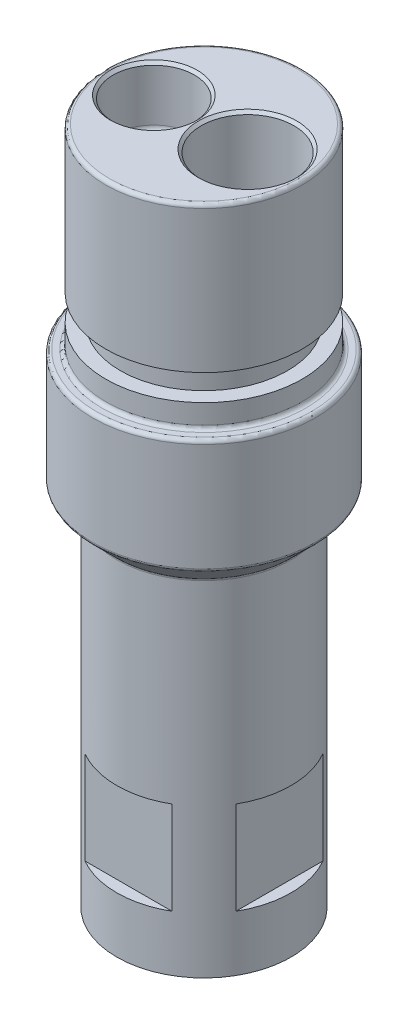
ISO-10303-21;
HEADER;
FILE_DESCRIPTION(('STEP AP214'),'2;1');
FILE_NAME('part.step','',(''),(''),'','','');
FILE_SCHEMA(('AUTOMOTIVE_DESIGN { 1 0 10303 214 1 1 1 1 }'));
ENDSEC;
DATA;
#1=APPLICATION_CONTEXT('core data for automotive mechanical design processes');
#2=APPLICATION_PROTOCOL_DEFINITION('international standard','automotive_design',2000,#1);
#3=PRODUCT_CONTEXT('',#1,'mechanical');
#4=PRODUCT('Part','Part','',(#3));
#5=PRODUCT_RELATED_PRODUCT_CATEGORY('part','',(#4));
#6=PRODUCT_DEFINITION_FORMATION('','',#4);
#7=PRODUCT_DEFINITION_CONTEXT('part definition',#1,'design');
#8=PRODUCT_DEFINITION('design','',#6,#7);
#9=PRODUCT_DEFINITION_SHAPE('','',#8);
#10=(LENGTH_UNIT() NAMED_UNIT(*) SI_UNIT(.MILLI.,.METRE.));
#11=(NAMED_UNIT(*) PLANE_ANGLE_UNIT() SI_UNIT($,.RADIAN.));
#12=(NAMED_UNIT(*) SI_UNIT($,.STERADIAN.) SOLID_ANGLE_UNIT());
#13=UNCERTAINTY_MEASURE_WITH_UNIT(LENGTH_MEASURE(1.E-05),#10,'distance_accuracy_value','');
#14=(GEOMETRIC_REPRESENTATION_CONTEXT(3) GLOBAL_UNCERTAINTY_ASSIGNED_CONTEXT((#13)) GLOBAL_UNIT_ASSIGNED_CONTEXT((#10,
#11,#12)) REPRESENTATION_CONTEXT('',''));
#15=CARTESIAN_POINT('',(0.,0.,0.));
#16=DIRECTION('',(0.,0.,1.));
#17=DIRECTION('',(1.,0.,0.));
#18=AXIS2_PLACEMENT_3D('',#15,#16,#17);
#19=CARTESIAN_POINT('',(0.,0.,0.));
#20=DIRECTION('',(0.,1.,0.));
#21=DIRECTION('',(0.,0.,1.));
#22=AXIS2_PLACEMENT_3D('',#19,#20,#21);
#23=CYLINDRICAL_SURFACE('',#22,11.9126);
#24=CARTESIAN_POINT('',(0.,20.32,0.));
#25=DIRECTION('',(0.,-1.,0.));
#26=DIRECTION('',(0.,0.,-1.));
#27=AXIS2_PLACEMENT_3D('',#24,#25,#26);
#28=CIRCLE('',#27,11.9126);
#29=CARTESIAN_POINT('',(5.95259919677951,20.32,-10.31875));
#30=VERTEX_POINT('',#29);
#31=CARTESIAN_POINT('',(-5.95259919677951,20.32,-10.31875));
#32=VERTEX_POINT('',#31);
#33=EDGE_CURVE('E170',#30,#32,#28,.F.);
#34=ORIENTED_EDGE('',*,*,#33,.T.);
#35=DIRECTION('',(0.,1.,0.));
#36=VECTOR('',#35,1.);
#37=CARTESIAN_POINT('',(-5.95259919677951,0.,-10.31875));
#38=LINE('',#37,#36);
#39=CARTESIAN_POINT('',(-5.95259919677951,7.62,-10.31875));
#40=VERTEX_POINT('',#39);
#41=EDGE_CURVE('E167',#32,#40,#38,.F.);
#42=ORIENTED_EDGE('',*,*,#41,.T.);
#43=CARTESIAN_POINT('',(0.,7.62,0.));
#44=DIRECTION('',(0.,-1.,0.));
#45=DIRECTION('',(0.,0.,-1.));
#46=AXIS2_PLACEMENT_3D('',#43,#44,#45);
#47=CIRCLE('',#46,11.9126);
#48=CARTESIAN_POINT('',(5.9525991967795,7.62,-10.31875));
#49=VERTEX_POINT('',#48);
#50=EDGE_CURVE('E166',#49,#40,#47,.F.);
#51=ORIENTED_EDGE('',*,*,#50,.F.);
#52=DIRECTION('',(0.,1.,0.));
#53=VECTOR('',#52,1.);
#54=CARTESIAN_POINT('',(5.95259919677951,0.,-10.31875));
#55=LINE('',#54,#53);
#56=EDGE_CURVE('E163',#49,#30,#55,.T.);
#57=ORIENTED_EDGE('',*,*,#56,.T.);
#58=EDGE_LOOP('',(#34,#42,#51,#57));
#59=FACE_BOUND('',#58,.T.);
#60=CARTESIAN_POINT('',(-5.95259919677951,20.32,10.31875));
#61=VERTEX_POINT('',#60);
#62=CARTESIAN_POINT('',(5.95259919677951,20.32,10.31875));
#63=VERTEX_POINT('',#62);
#64=EDGE_CURVE('E138',#61,#63,#28,.F.);
#65=ORIENTED_EDGE('',*,*,#64,.T.);
#66=DIRECTION('',(0.,1.,0.));
#67=VECTOR('',#66,1.);
#68=CARTESIAN_POINT('',(5.95259919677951,0.,10.31875));
#69=LINE('',#68,#67);
#70=CARTESIAN_POINT('',(5.95259919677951,7.62,10.31875));
#71=VERTEX_POINT('',#70);
#72=EDGE_CURVE('E145',#63,#71,#69,.F.);
#73=ORIENTED_EDGE('',*,*,#72,.T.);
#74=CARTESIAN_POINT('',(-5.95259919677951,7.62,10.31875));
#75=VERTEX_POINT('',#74);
#76=EDGE_CURVE('E131',#75,#71,#47,.F.);
#77=ORIENTED_EDGE('',*,*,#76,.F.);
#78=DIRECTION('',(0.,1.,0.));
#79=VECTOR('',#78,1.);
#80=CARTESIAN_POINT('',(-5.95259919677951,0.,10.31875));
#81=LINE('',#80,#79);
#82=EDGE_CURVE('E139',#75,#61,#81,.T.);
#83=ORIENTED_EDGE('',*,*,#82,.T.);
#84=EDGE_LOOP('',(#65,#73,#77,#83));
#85=FACE_BOUND('',#84,.T.);
#86=CARTESIAN_POINT('',(0.,0.,0.));
#87=DIRECTION('',(0.,1.,0.));
#88=DIRECTION('',(0.,0.,1.));
#89=AXIS2_PLACEMENT_3D('',#86,#87,#88);
#90=CIRCLE('',#89,11.9126);
#91=CARTESIAN_POINT('',(0.,0.,11.9126));
#92=VERTEX_POINT('',#91);
#93=EDGE_CURVE('E242',#92,#92,#90,.T.);
#94=ORIENTED_EDGE('',*,*,#93,.T.);
#95=EDGE_LOOP('',(#94));
#96=FACE_BOUND('',#95,.T.);
#97=CARTESIAN_POINT('',(0.,47.0517590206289,0.));
#98=DIRECTION('',(0.,1.,0.));
#99=DIRECTION('',(0.,0.,1.));
#100=AXIS2_PLACEMENT_3D('',#97,#98,#99);
#101=CIRCLE('',#100,11.9126);
#102=CARTESIAN_POINT('',(0.,47.0517590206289,11.9126));
#103=VERTEX_POINT('',#102);
#104=EDGE_CURVE('E245',#103,#103,#101,.T.);
#105=ORIENTED_EDGE('',*,*,#104,.F.);
#106=EDGE_LOOP('',(#105));
#107=FACE_BOUND('',#106,.T.);
#108=CARTESIAN_POINT('',(-10.31875,20.32,-5.95259919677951));
#109=VERTEX_POINT('',#108);
#110=CARTESIAN_POINT('',(-10.31875,20.32,5.9525991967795));
#111=VERTEX_POINT('',#110);
#112=EDGE_CURVE('E158',#109,#111,#28,.F.);
#113=ORIENTED_EDGE('',*,*,#112,.T.);
#114=DIRECTION('',(0.,1.,0.));
#115=VECTOR('',#114,1.);
#116=CARTESIAN_POINT('',(-10.31875,0.,5.95259919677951));
#117=LINE('',#116,#115);
#118=CARTESIAN_POINT('',(-10.31875,7.62,5.9525991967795));
#119=VERTEX_POINT('',#118);
#120=EDGE_CURVE('E160',#111,#119,#117,.F.);
#121=ORIENTED_EDGE('',*,*,#120,.T.);
#122=CARTESIAN_POINT('',(-10.31875,7.62,-5.95259919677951));
#123=VERTEX_POINT('',#122);
#124=EDGE_CURVE('E142',#123,#119,#47,.F.);
#125=ORIENTED_EDGE('',*,*,#124,.F.);
#126=DIRECTION('',(0.,1.,0.));
#127=VECTOR('',#126,1.);
#128=CARTESIAN_POINT('',(-10.31875,0.,-5.95259919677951));
#129=LINE('',#128,#127);
#130=EDGE_CURVE('E153',#123,#109,#129,.T.);
#131=ORIENTED_EDGE('',*,*,#130,.T.);
#132=EDGE_LOOP('',(#113,#121,#125,#131));
#133=FACE_BOUND('',#132,.T.);
#134=CARTESIAN_POINT('',(10.31875,20.32,5.95259919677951));
#135=VERTEX_POINT('',#134);
#136=CARTESIAN_POINT('',(10.31875,20.32,-5.95259919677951));
#137=VERTEX_POINT('',#136);
#138=EDGE_CURVE('E41',#135,#137,#28,.F.);
#139=ORIENTED_EDGE('',*,*,#138,.T.);
#140=DIRECTION('',(0.,1.,0.));
#141=VECTOR('',#140,1.);
#142=CARTESIAN_POINT('',(10.31875,0.,-5.95259919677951));
#143=LINE('',#142,#141);
#144=CARTESIAN_POINT('',(10.31875,7.62,-5.95259919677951));
#145=VERTEX_POINT('',#144);
#146=EDGE_CURVE('E12',#137,#145,#143,.F.);
#147=ORIENTED_EDGE('',*,*,#146,.T.);
#148=CARTESIAN_POINT('',(10.31875,7.62,5.95259919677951));
#149=VERTEX_POINT('',#148);
#150=EDGE_CURVE('E141',#149,#145,#47,.F.);
#151=ORIENTED_EDGE('',*,*,#150,.F.);
#152=DIRECTION('',(0.,1.,0.));
#153=VECTOR('',#152,1.);
#154=CARTESIAN_POINT('',(10.31875,0.,5.95259919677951));
#155=LINE('',#154,#153);
#156=EDGE_CURVE('E169',#149,#135,#155,.T.);
#157=ORIENTED_EDGE('',*,*,#156,.T.);
#158=EDGE_LOOP('',(#139,#147,#151,#157));
#159=FACE_BOUND('',#158,.T.);
#160=ADVANCED_FACE('F33',(#59,#85,#96,#107,#133,#159),#23,.T.);
#161=CARTESIAN_POINT('',(0.,0.,0.));
#162=DIRECTION('',(0.,1.,0.));
#163=DIRECTION('',(0.,0.,1.));
#164=AXIS2_PLACEMENT_3D('',#161,#162,#163);
#165=CYLINDRICAL_SURFACE('',#164,5.7531);
#166=CARTESIAN_POINT('',(0.,3.40392789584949,0.));
#167=DIRECTION('',(0.,1.,0.));
#168=DIRECTION('',(0.,0.,1.));
#169=AXIS2_PLACEMENT_3D('',#166,#167,#168);
#170=CIRCLE('',#169,5.75310000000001);
#171=CARTESIAN_POINT('',(0.,3.40392789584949,5.75310000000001));
#172=VERTEX_POINT('',#171);
#173=EDGE_CURVE('E291',#172,#172,#170,.T.);
#174=ORIENTED_EDGE('',*,*,#173,.F.);
#175=EDGE_LOOP('',(#174));
#176=FACE_BOUND('',#175,.T.);
#177=CARTESIAN_POINT('',(5.14388956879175,54.6102,2.57654026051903));
#178=CARTESIAN_POINT('',(5.18629817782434,54.5539828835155,2.49187689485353));
#179=CARTESIAN_POINT('',(5.22658505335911,54.4976561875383,2.40622440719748));
#180=CARTESIAN_POINT('',(5.30285108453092,54.3848226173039,2.23313040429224));
#181=CARTESIAN_POINT('',(5.3388299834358,54.3283157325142,2.14568878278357));
#182=CARTESIAN_POINT('',(5.40648314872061,54.2150462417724,1.96902678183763));
#183=CARTESIAN_POINT('',(5.43814802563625,54.1582833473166,1.87980299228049));
#184=CARTESIAN_POINT('',(5.49702372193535,54.0446815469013,1.69995360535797));
#185=CARTESIAN_POINT('',(5.52423482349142,53.9878426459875,1.60932809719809));
#186=CARTESIAN_POINT('',(5.57394993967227,53.8746379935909,1.42760028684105));
#187=CARTESIAN_POINT('',(5.59649102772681,53.818272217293,1.33650812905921));
#188=CARTESIAN_POINT('',(5.63711142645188,53.705659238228,1.15323369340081));
#189=CARTESIAN_POINT('',(5.65518994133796,53.64941205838,1.06105122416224));
#190=CARTESIAN_POINT('',(5.67892018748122,53.5654121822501,0.922078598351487));
#191=CARTESIAN_POINT('',(5.68626167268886,53.5374937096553,0.875671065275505));
#192=CARTESIAN_POINT('',(5.69982011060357,53.4818436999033,0.782575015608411));
#193=CARTESIAN_POINT('',(5.70603699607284,53.4541121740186,0.735886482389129));
#194=CARTESIAN_POINT('',(5.71733966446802,53.3989981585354,0.642193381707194));
#195=CARTESIAN_POINT('',(5.72242588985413,53.3716155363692,0.595188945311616));
#196=CARTESIAN_POINT('',(5.7314658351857,53.3174793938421,0.50071378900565));
#197=CARTESIAN_POINT('',(5.73541972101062,53.2907257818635,0.453243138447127));
#198=CARTESIAN_POINT('',(5.74007386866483,53.2549233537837,0.387344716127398));
#199=CARTESIAN_POINT('',(5.74126413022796,53.2452506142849,0.369290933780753));
#200=CARTESIAN_POINT('',(5.74348275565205,53.2262100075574,0.333010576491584));
#201=CARTESIAN_POINT('',(5.7445111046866,53.216842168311,0.314783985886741));
#202=CARTESIAN_POINT('',(5.74641039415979,53.1984942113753,0.277973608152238));
#203=CARTESIAN_POINT('',(5.74728023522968,53.1895171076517,0.259388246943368));
#204=CARTESIAN_POINT('',(5.74885030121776,53.1722806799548,0.221882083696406));
#205=CARTESIAN_POINT('',(5.74955056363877,53.1640211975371,0.202961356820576));
#206=CARTESIAN_POINT('',(5.75092626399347,53.1467460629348,0.159935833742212));
#207=CARTESIAN_POINT('',(5.75155333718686,53.1380431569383,0.135699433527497));
#208=CARTESIAN_POINT('',(5.75250192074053,53.1241019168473,0.0864521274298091));
#209=CARTESIAN_POINT('',(5.75282714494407,53.1188217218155,0.0614546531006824));
#210=CARTESIAN_POINT('',(5.75306752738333,53.1148815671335,0.0232650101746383));
#211=CARTESIAN_POINT('',(5.75310547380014,53.1142463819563,0.0102821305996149));
#212=CARTESIAN_POINT('',(5.75309326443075,53.1144500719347,-0.0156706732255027));
#213=CARTESIAN_POINT('',(5.75304311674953,53.1152888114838,-0.0286405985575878));
#214=CARTESIAN_POINT('',(5.75285617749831,53.1183348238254,-0.0545453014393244));
#215=CARTESIAN_POINT('',(5.75271850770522,53.1205559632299,-0.0674783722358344));
#216=CARTESIAN_POINT('',(5.7523609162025,53.1261107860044,-0.0931014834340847));
#217=CARTESIAN_POINT('',(5.75214094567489,53.1294451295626,-0.105791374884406));
#218=CARTESIAN_POINT('',(5.75151852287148,53.1384704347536,-0.136042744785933));
#219=CARTESIAN_POINT('',(5.75107823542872,53.14456787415,-0.153479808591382));
#220=CARTESIAN_POINT('',(5.75005486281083,53.1578106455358,-0.187952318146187));
#221=CARTESIAN_POINT('',(5.74947163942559,53.1649569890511,-0.204987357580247));
#222=CARTESIAN_POINT('',(5.74751391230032,53.1874085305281,-0.255721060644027));
#223=CARTESIAN_POINT('',(5.74593304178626,53.2036986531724,-0.288970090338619));
#224=CARTESIAN_POINT('',(5.74222872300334,53.2375479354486,-0.355062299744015));
#225=CARTESIAN_POINT('',(5.74010146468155,53.2551153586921,-0.387900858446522));
#226=CARTESIAN_POINT('',(5.73531971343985,53.2908490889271,-0.453138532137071));
#227=CARTESIAN_POINT('',(5.73266613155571,53.3090143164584,-0.485538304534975));
#228=CARTESIAN_POINT('',(5.72395970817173,53.3637501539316,-0.581881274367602));
#229=CARTESIAN_POINT('',(5.71713284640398,53.4008287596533,-0.645465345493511));
#230=CARTESIAN_POINT('',(5.70141514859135,53.4755216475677,-0.772067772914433));
#231=CARTESIAN_POINT('',(5.69252404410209,53.5131359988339,-0.835086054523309));
#232=CARTESIAN_POINT('',(5.67267608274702,53.5886685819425,-0.960704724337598));
#233=CARTESIAN_POINT('',(5.6617170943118,53.6265870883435,-1.02330461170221));
#234=CARTESIAN_POINT('',(5.63774993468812,53.7025488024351,-1.14802753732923));
#235=CARTESIAN_POINT('',(5.62474186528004,53.7405920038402,-1.21015059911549));
#236=CARTESIAN_POINT('',(5.58280711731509,53.8543970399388,-1.39511775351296));
#237=CARTESIAN_POINT('',(5.55086238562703,53.930244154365,-1.51723849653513));
#238=CARTESIAN_POINT('',(5.47901619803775,54.0818264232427,-1.75910349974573));
#239=CARTESIAN_POINT('',(5.43911852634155,54.1575616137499,-1.8788488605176));
#240=CARTESIAN_POINT('',(5.37706348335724,54.2646686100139,-2.04648750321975));
#241=CARTESIAN_POINT('',(5.3581399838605,54.2961387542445,-2.09553346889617));
#242=CARTESIAN_POINT('',(5.31894525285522,54.359032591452,-2.19311308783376));
#243=CARTESIAN_POINT('',(5.29867407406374,54.3904562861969,-2.24164676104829));
#244=CARTESIAN_POINT('',(5.25676044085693,54.453301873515,-2.33824850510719));
#245=CARTESIAN_POINT('',(5.23511577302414,54.4847236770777,-2.3863156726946));
#246=CARTESIAN_POINT('',(5.19049674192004,54.5475081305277,-2.48187106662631));
#247=CARTESIAN_POINT('',(5.1675223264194,54.5788707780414,-2.52935927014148));
#248=CARTESIAN_POINT('',(5.14388956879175,54.6102,-2.57654026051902));
#249=B_SPLINE_CURVE_WITH_KNOTS('',3,(#177,#178,#179,#180,#181,#182,#183,#184,#185,#186,#187,
#188,#189,#190,#191,#192,#193,#194,#195,#196,#197,#198,#199,#200,#201,#202,#203,#204,#205,#206,
#207,#208,#209,#210,#211,#212,#213,#214,#215,#216,#217,#218,#219,#220,#221,#222,#223,#224,#225,
#226,#227,#228,#229,#230,#231,#232,#233,#234,#235,#236,#237,#238,#239,#240,#241,#242,#243,#244,
#245,#246,#247,#248),.UNSPECIFIED.,.F.,.F.,(4,2,2,2,2,2,2,2,2,2,2,2,2,2,2,2,2,2,2,2,2,2,2,2,2,2,
2,2,2,2,2,2,2,2,2,4),(0.,0.330338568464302,0.660696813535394,0.991762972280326,1.3228081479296,
1.65111504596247,1.97948044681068,2.14343074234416,2.30739083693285,2.47128665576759,
2.63515845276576,2.69670476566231,2.75825671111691,2.82022053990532,2.88217065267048,
2.95934049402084,3.03554776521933,3.07446159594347,3.11337184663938,3.15267883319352,
3.192009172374,3.24738350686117,3.30281159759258,3.41391576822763,3.52581677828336,
3.63752575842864,3.8592484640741,4.08100001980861,4.30298141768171,4.52495179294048,
4.96649577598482,5.40783016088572,5.59162622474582,5.77541510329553,5.95950807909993,
6.14360829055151),.UNSPECIFIED.);
#250=CARTESIAN_POINT('',(5.14404042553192,54.61,2.57623906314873));
#251=VERTEX_POINT('',#250);
#252=CARTESIAN_POINT('',(5.14404042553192,54.61,-2.57623906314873));
#253=VERTEX_POINT('',#252);
#254=EDGE_CURVE('E426',#251,#253,#249,.T.);
#255=ORIENTED_EDGE('',*,*,#254,.T.);
#256=DIRECTION('',(0.,1.,0.));
#257=VECTOR('',#256,1.);
#258=CARTESIAN_POINT('',(5.14404042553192,64.77,-2.57623906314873));
#259=LINE('',#258,#257);
#260=CARTESIAN_POINT('',(5.14404042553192,66.5594530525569,-2.57623906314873));
#261=VERTEX_POINT('',#260);
#262=EDGE_CURVE('E221',#253,#261,#259,.T.);
#263=ORIENTED_EDGE('',*,*,#262,.T.);
#264=CARTESIAN_POINT('',(0.,66.5594530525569,0.));
#265=DIRECTION('',(0.,1.,0.));
#266=DIRECTION('',(0.,0.,1.));
#267=AXIS2_PLACEMENT_3D('',#264,#265,#266);
#268=CIRCLE('',#267,5.7531);
#269=CARTESIAN_POINT('',(-5.3086,66.5594530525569,-2.21741418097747));
#270=VERTEX_POINT('',#269);
#271=EDGE_CURVE('E287',#261,#270,#268,.T.);
#272=ORIENTED_EDGE('',*,*,#271,.T.);
#273=DIRECTION('',(0.,1.,0.));
#274=VECTOR('',#273,1.);
#275=CARTESIAN_POINT('',(-5.3086,69.5325,-2.21741418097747));
#276=LINE('',#275,#274);
#277=CARTESIAN_POINT('',(-5.3086,54.61,-2.21741418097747));
#278=VERTEX_POINT('',#277);
#279=EDGE_CURVE('E236',#270,#278,#276,.F.);
#280=ORIENTED_EDGE('',*,*,#279,.T.);
#281=CARTESIAN_POINT('',(-5.30846869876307,54.6102000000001,-2.21772849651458));
#282=CARTESIAN_POINT('',(-5.32916084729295,54.5786854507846,-2.16819738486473));
#283=CARTESIAN_POINT('',(-5.3491826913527,54.5472709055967,-2.11832460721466));
#284=CARTESIAN_POINT('',(-5.38787479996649,54.4847119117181,-2.0178855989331));
#285=CARTESIAN_POINT('',(-5.40654498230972,54.4535674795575,-1.96731932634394));
#286=CARTESIAN_POINT('',(-5.46059009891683,54.3605087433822,-1.81434158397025));
#287=CARTESIAN_POINT('',(-5.49390494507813,54.2991136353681,-1.71087740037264));
#288=CARTESIAN_POINT('',(-5.55627306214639,54.1759818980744,-1.49633772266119));
#289=CARTESIAN_POINT('',(-5.58507389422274,54.1143494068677,-1.38512772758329));
#290=CARTESIAN_POINT('',(-5.62353309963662,54.0254023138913,-1.21547809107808));
#291=CARTESIAN_POINT('',(-5.63555835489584,53.9963485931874,-1.15848080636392));
#292=CARTESIAN_POINT('',(-5.65799824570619,53.9398519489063,-1.04338607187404));
#293=CARTESIAN_POINT('',(-5.66841318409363,53.9124087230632,-0.98528883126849));
#294=CARTESIAN_POINT('',(-5.68651545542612,53.8626902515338,-0.874355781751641));
#295=CARTESIAN_POINT('',(-5.69437738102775,53.8401798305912,-0.821654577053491));
#296=CARTESIAN_POINT('',(-5.70873895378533,53.7975558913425,-0.715087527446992));
#297=CARTESIAN_POINT('',(-5.71523841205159,53.7774427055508,-0.661221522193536));
#298=CARTESIAN_POINT('',(-5.72674008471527,53.7406665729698,-0.552766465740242));
#299=CARTESIAN_POINT('',(-5.73175685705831,53.723970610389,-0.498190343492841));
#300=CARTESIAN_POINT('',(-5.74028237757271,53.694849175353,-0.387786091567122));
#301=CARTESIAN_POINT('',(-5.74379180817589,53.6824217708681,-0.331958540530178));
#302=CARTESIAN_POINT('',(-5.74864450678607,53.6649609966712,-0.230783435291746));
#303=CARTESIAN_POINT('',(-5.75028373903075,53.6589360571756,-0.185623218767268));
#304=CARTESIAN_POINT('',(-5.75249547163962,53.6507666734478,-0.0949277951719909));
#305=CARTESIAN_POINT('',(-5.75306823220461,53.648621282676,-0.0493926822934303));
#306=CARTESIAN_POINT('',(-5.75312918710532,53.6483940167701,0.0416863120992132));
#307=CARTESIAN_POINT('',(-5.75261744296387,53.6503119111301,0.0872301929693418));
#308=CARTESIAN_POINT('',(-5.7505261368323,53.6580441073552,0.177960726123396));
#309=CARTESIAN_POINT('',(-5.74894632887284,53.6638593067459,0.223147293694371));
#310=CARTESIAN_POINT('',(-5.74386839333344,53.6821654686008,0.332023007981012));
#311=CARTESIAN_POINT('',(-5.73983949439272,53.6964457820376,0.39538471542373));
#312=CARTESIAN_POINT('',(-5.72985117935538,53.7303747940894,0.520494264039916));
#313=CARTESIAN_POINT('',(-5.72389011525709,53.7500280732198,0.582240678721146));
#314=CARTESIAN_POINT('',(-5.71009364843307,53.7934336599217,0.704870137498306));
#315=CARTESIAN_POINT('',(-5.70223679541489,53.8172319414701,0.765734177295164));
#316=CARTESIAN_POINT('',(-5.6847831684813,53.8676108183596,0.886057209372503));
#317=CARTESIAN_POINT('',(-5.67518565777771,53.8941925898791,0.945515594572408));
#318=CARTESIAN_POINT('',(-5.65502088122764,53.9474693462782,1.05924735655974));
#319=CARTESIAN_POINT('',(-5.64456226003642,53.9740364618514,1.11360049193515));
#320=CARTESIAN_POINT('',(-5.62222619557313,54.0284373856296,1.22137623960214));
#321=CARTESIAN_POINT('',(-5.61034858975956,54.0562713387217,1.27479874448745));
#322=CARTESIAN_POINT('',(-5.57261272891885,54.1412050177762,1.43389078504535));
#323=CARTESIAN_POINT('',(-5.54466272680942,54.1997060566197,1.53832176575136));
#324=CARTESIAN_POINT('',(-5.4846260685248,54.3163347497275,1.74000832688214));
#325=CARTESIAN_POINT('',(-5.45276161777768,54.3743754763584,1.83738126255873));
#326=CARTESIAN_POINT('',(-5.40133566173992,54.4622870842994,1.98149627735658));
#327=CARTESIAN_POINT('',(-5.38360443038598,54.4917088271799,2.02917318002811));
#328=CARTESIAN_POINT('',(-5.34693745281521,54.5507905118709,2.12391113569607));
#329=CARTESIAN_POINT('',(-5.32800172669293,54.5804504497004,2.17097219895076));
#330=CARTESIAN_POINT('',(-5.30846869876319,54.6102,2.21772849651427));
#331=B_SPLINE_CURVE_WITH_KNOTS('',3,(#281,#282,#283,#284,#285,#286,#287,#288,#289,#290,#291,
#292,#293,#294,#295,#296,#297,#298,#299,#300,#301,#302,#303,#304,#305,#306,#307,#308,#309,#310,
#311,#312,#313,#314,#315,#316,#317,#318,#319,#320,#321,#322,#323,#324,#325,#326,#327,#328,#329,
#330),.UNSPECIFIED.,.F.,.F.,(4,2,2,2,2,2,2,2,2,2,2,2,2,2,2,2,2,2,2,2,2,2,2,2,4),(0.,
0.186732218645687,0.373475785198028,0.747816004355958,1.13864966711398,1.33389920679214,
1.52911198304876,1.70258458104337,1.87608121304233,2.04781297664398,2.21946690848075,
2.35607641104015,2.49265257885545,2.62922099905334,2.76582088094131,2.96067550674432,
3.15569676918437,3.35303763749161,3.55046223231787,3.73460799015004,3.91877486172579,
4.28732114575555,4.64043613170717,4.81671177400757,4.99298447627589),.UNSPECIFIED.);
#332=CARTESIAN_POINT('',(-5.3086,54.61,2.21741418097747));
#333=VERTEX_POINT('',#332);
#334=EDGE_CURVE('E320',#278,#333,#331,.T.);
#335=ORIENTED_EDGE('',*,*,#334,.T.);
#336=DIRECTION('',(0.,1.,0.));
#337=VECTOR('',#336,1.);
#338=CARTESIAN_POINT('',(-5.3086,69.5325,2.21741418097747));
#339=LINE('',#338,#337);
#340=CARTESIAN_POINT('',(-5.3086,66.5594530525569,2.21741418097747));
#341=VERTEX_POINT('',#340);
#342=EDGE_CURVE('E239',#333,#341,#339,.T.);
#343=ORIENTED_EDGE('',*,*,#342,.T.);
#344=CARTESIAN_POINT('',(5.14404042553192,66.5594530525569,2.57623906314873));
#345=VERTEX_POINT('',#344);
#346=EDGE_CURVE('E288',#341,#345,#268,.T.);
#347=ORIENTED_EDGE('',*,*,#346,.T.);
#348=DIRECTION('',(0.,1.,0.));
#349=VECTOR('',#348,1.);
#350=CARTESIAN_POINT('',(5.14404042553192,64.77,2.57623906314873));
#351=LINE('',#350,#349);
#352=EDGE_CURVE('E218',#345,#251,#351,.F.);
#353=ORIENTED_EDGE('',*,*,#352,.T.);
#354=EDGE_LOOP('',(#255,#263,#272,#280,#335,#343,#347,#353));
#355=FACE_BOUND('',#354,.T.);
#356=ADVANCED_FACE('F345',(#176,#355),#165,.F.);
#357=CARTESIAN_POINT('',(0.,66.5594530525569,0.));
#358=DIRECTION('',(0.,-1.,0.));
#359=DIRECTION('',(0.,0.,-1.));
#360=AXIS2_PLACEMENT_3D('',#357,#358,#359);
#361=CONICAL_SURFACE('',#360,5.7531,1.02974425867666);
#362=CARTESIAN_POINT('',(0.,70.0162642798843,0.));
#363=VERTEX_POINT('',#362);
#364=VERTEX_LOOP('',#363);
#365=FACE_BOUND('',#364,.T.);
#366=ORIENTED_EDGE('',*,*,#271,.F.);
#367=CARTESIAN_POINT('',(5.14436125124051,66.5592530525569,-2.57634177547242));
#368=CARTESIAN_POINT('',(5.05038281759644,66.6178184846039,-2.54626043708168));
#369=CARTESIAN_POINT('',(4.95826328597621,66.6767492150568,-2.51110667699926));
#370=CARTESIAN_POINT('',(4.77847990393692,66.7948628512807,-2.43103177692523));
#371=CARTESIAN_POINT('',(4.6908178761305,66.8540458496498,-2.38610668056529));
#372=CARTESIAN_POINT('',(4.51977045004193,66.9728278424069,-2.28631142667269));
#373=CARTESIAN_POINT('',(4.43644706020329,67.032423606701,-2.2313311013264));
#374=CARTESIAN_POINT('',(4.27597048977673,67.1506689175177,-2.11215619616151));
#375=CARTESIAN_POINT('',(4.19881581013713,67.2093186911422,-2.04796386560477));
#376=CARTESIAN_POINT('',(4.05951046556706,67.3185156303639,-1.9181913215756));
#377=CARTESIAN_POINT('',(3.99664220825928,67.3692461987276,-1.85353473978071));
#378=CARTESIAN_POINT('',(3.87694494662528,67.4685586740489,-1.71729321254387));
#379=CARTESIAN_POINT('',(3.82011708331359,67.5171401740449,-1.64570696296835));
#380=CARTESIAN_POINT('',(3.71342118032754,67.6109087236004,-1.49610478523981));
#381=CARTESIAN_POINT('',(3.66352047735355,67.6561112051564,-1.41812199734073));
#382=CARTESIAN_POINT('',(3.57114852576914,67.7420180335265,-1.25562847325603));
#383=CARTESIAN_POINT('',(3.52867117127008,67.7827260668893,-1.17112318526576));
#384=CARTESIAN_POINT('',(3.44621862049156,67.8636444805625,-0.98248022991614));
#385=CARTESIAN_POINT('',(3.40758906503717,67.9028521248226,-0.877304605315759));
#386=CARTESIAN_POINT('',(3.34311156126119,67.969648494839,-0.659636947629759));
#387=CARTESIAN_POINT('',(3.31724466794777,67.9972544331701,-0.547156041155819));
#388=CARTESIAN_POINT('',(3.27984304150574,68.0375642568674,-0.315931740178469));
#389=CARTESIAN_POINT('',(3.2684499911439,68.0501207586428,-0.197138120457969));
#390=CARTESIAN_POINT('',(3.26159032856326,68.0576488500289,0.0414584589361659));
#391=CARTESIAN_POINT('',(3.26611663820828,68.0526282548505,0.161260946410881));
#392=CARTESIAN_POINT('',(3.28901943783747,68.0276769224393,0.382115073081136));
#393=CARTESIAN_POINT('',(3.3055495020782,68.009736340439,0.483604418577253));
#394=CARTESIAN_POINT('',(3.34925249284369,67.9633362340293,0.681763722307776));
#395=CARTESIAN_POINT('',(3.37643469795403,67.934867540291,0.778429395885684));
#396=CARTESIAN_POINT('',(3.4547215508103,67.8550722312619,1.0083106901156));
#397=CARTESIAN_POINT('',(3.51108375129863,67.7992380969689,1.13815947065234));
#398=CARTESIAN_POINT('',(3.64049511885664,67.6768206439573,1.38383123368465));
#399=CARTESIAN_POINT('',(3.71358390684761,67.6102119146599,1.49961989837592));
#400=CARTESIAN_POINT('',(3.84525206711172,67.4955949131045,1.67772468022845));
#401=CARTESIAN_POINT('',(3.89969432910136,67.4494369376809,1.74437189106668));
#402=CARTESIAN_POINT('',(4.01391955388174,67.3552635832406,1.87150703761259));
#403=CARTESIAN_POINT('',(4.07370415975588,67.3072476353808,1.93199306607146));
#404=CARTESIAN_POINT('',(4.26030888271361,67.1614389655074,2.1039266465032));
#405=CARTESIAN_POINT('',(4.39450919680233,67.0617715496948,2.2060221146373));
#406=CARTESIAN_POINT('',(4.63165214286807,66.8944557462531,2.35407527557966));
#407=CARTESIAN_POINT('',(4.73030721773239,66.8270878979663,2.40744255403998));
#408=CARTESIAN_POINT('',(4.93328852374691,66.6927536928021,2.50146257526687));
#409=CARTESIAN_POINT('',(5.03759762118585,66.6257867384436,2.54215145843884));
#410=CARTESIAN_POINT('',(5.14436125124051,66.5592530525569,2.57634177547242));
#411=B_SPLINE_CURVE_WITH_KNOTS('',3,(#367,#368,#369,#370,#371,#372,#373,#374,#375,#376,#377,
#378,#379,#380,#381,#382,#383,#384,#385,#386,#387,#388,#389,#390,#391,#392,#393,#394,#395,#396,
#397,#398,#399,#400,#401,#402,#403,#404,#405,#406,#407,#408,#409,#410),.UNSPECIFIED.,.F.,.F.,(4,
2,2,2,2,2,2,2,2,2,2,2,2,2,2,2,2,2,2,2,2,4),(0.,0.344103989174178,0.688347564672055,
1.03661725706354,1.38480205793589,1.69481609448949,2.00488858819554,2.31344537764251,
2.62174716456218,2.97658821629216,3.33090094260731,3.68865592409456,4.04625185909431,
4.35808877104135,4.67019791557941,5.12422473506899,5.57933836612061,5.87195373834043,
6.16465941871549,6.7493483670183,7.14121062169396,7.53194541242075),.UNSPECIFIED.);
#412=EDGE_CURVE('E482',#261,#345,#411,.T.);
#413=ORIENTED_EDGE('',*,*,#412,.T.);
#414=ORIENTED_EDGE('',*,*,#346,.F.);
#415=CARTESIAN_POINT('',(-5.30887923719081,66.5592530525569,2.21760926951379));
#416=CARTESIAN_POINT('',(-5.24417249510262,66.6055849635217,2.17240142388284));
#417=CARTESIAN_POINT('',(-5.18126452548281,66.6515841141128,2.12424818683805));
#418=CARTESIAN_POINT('',(-5.05938759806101,66.7425038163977,2.02210216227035));
#419=CARTESIAN_POINT('',(-5.00042314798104,66.7874230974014,1.96810287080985));
#420=CARTESIAN_POINT('',(-4.88638881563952,66.8760782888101,1.85388398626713));
#421=CARTESIAN_POINT('',(-4.83136073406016,66.9197991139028,1.79361071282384));
#422=CARTESIAN_POINT('',(-4.72632900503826,67.0049538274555,1.6674180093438));
#423=CARTESIAN_POINT('',(-4.67632285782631,67.0463888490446,1.60150141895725));
#424=CARTESIAN_POINT('',(-4.55601195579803,67.148065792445,1.42654794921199));
#425=CARTESIAN_POINT('',(-4.48951500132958,67.206236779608,1.3136040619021));
#426=CARTESIAN_POINT('',(-4.37232922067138,67.3114609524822,1.07542004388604));
#427=CARTESIAN_POINT('',(-4.32158399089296,67.358553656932,0.950225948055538));
#428=CARTESIAN_POINT('',(-4.24659545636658,67.4294547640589,0.714379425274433));
#429=CARTESIAN_POINT('',(-4.21912565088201,67.4560042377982,0.605592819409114));
#430=CARTESIAN_POINT('',(-4.17778861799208,67.4962927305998,0.383139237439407));
#431=CARTESIAN_POINT('',(-4.16391125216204,67.510041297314,0.269475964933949));
#432=CARTESIAN_POINT('',(-4.15074929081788,67.5230750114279,0.0400336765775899));
#433=CARTESIAN_POINT('',(-4.15151763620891,67.5223076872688,-0.0757515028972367));
#434=CARTESIAN_POINT('',(-4.16771631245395,67.5062807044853,-0.305273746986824));
#435=CARTESIAN_POINT('',(-4.18315267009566,67.4910150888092,-0.419009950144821));
#436=CARTESIAN_POINT('',(-4.22648825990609,67.4488914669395,-0.635904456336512));
#437=CARTESIAN_POINT('',(-4.25375768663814,67.4226213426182,-0.739308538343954));
#438=CARTESIAN_POINT('',(-4.31917194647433,67.360908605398,-0.939706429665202));
#439=CARTESIAN_POINT('',(-4.35732368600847,67.3254601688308,-1.03669611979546));
#440=CARTESIAN_POINT('',(-4.46455138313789,67.2282127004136,-1.26990908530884));
#441=CARTESIAN_POINT('',(-4.53956417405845,67.1620845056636,-1.40160354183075));
#442=CARTESIAN_POINT('',(-4.70727526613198,67.020119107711,-1.64747306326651));
#443=CARTESIAN_POINT('',(-4.80001094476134,66.944261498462,-1.76161016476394));
#444=CARTESIAN_POINT('',(-4.96298770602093,66.816177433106,-1.9325660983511));
#445=CARTESIAN_POINT('',(-5.02882066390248,66.7656174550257,-1.99494633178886));
#446=CARTESIAN_POINT('',(-5.16531487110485,66.6632606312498,-2.11196676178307));
#447=CARTESIAN_POINT('',(-5.23594678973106,66.6114723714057,-2.16664863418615));
#448=CARTESIAN_POINT('',(-5.30887923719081,66.5592530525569,-2.21760926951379));
#449=B_SPLINE_CURVE_WITH_KNOTS('',3,(#415,#416,#417,#418,#419,#420,#421,#422,#423,#424,#425,
#426,#427,#428,#429,#430,#431,#432,#433,#434,#435,#436,#437,#438,#439,#440,#441,#442,#443,#444,
#445,#446,#447,#448),.UNSPECIFIED.,.F.,.F.,(4,2,2,2,2,2,2,2,2,2,2,2,2,2,2,2,4),(0.,
0.274538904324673,0.549386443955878,0.826816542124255,1.10410785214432,1.53266439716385,
1.95966818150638,2.30414648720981,2.64836765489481,2.99383333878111,3.33944102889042,
3.66855816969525,3.99788465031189,4.49129211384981,4.98575188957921,5.29688043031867,
5.60625392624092),.UNSPECIFIED.);
#450=EDGE_CURVE('E312',#341,#270,#449,.T.);
#451=ORIENTED_EDGE('',*,*,#450,.T.);
#452=EDGE_LOOP('',(#366,#413,#414,#451));
#453=FACE_BOUND('',#452,.T.);
#454=ADVANCED_FACE('F327',(#365,#453),#361,.F.);
#455=CARTESIAN_POINT('',(-12.92225,92.71,0.));
#456=DIRECTION('',(0.,1.,0.));
#457=DIRECTION('',(0.,0.,1.));
#458=AXIS2_PLACEMENT_3D('',#455,#456,#457);
#459=PLANE('',#458);
#460=CARTESIAN_POINT('',(5.969,92.71,0.));
#461=DIRECTION('',(0.,1.,0.));
#462=DIRECTION('',(0.,0.,1.));
#463=AXIS2_PLACEMENT_3D('',#460,#461,#462);
#464=CIRCLE('',#463,6.73099999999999);
#465=CARTESIAN_POINT('',(5.969,92.71,6.73099999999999));
#466=VERTEX_POINT('',#465);
#467=EDGE_CURVE('E413',#466,#466,#464,.F.);
#468=ORIENTED_EDGE('',*,*,#467,.T.);
#469=EDGE_LOOP('',(#468));
#470=FACE_BOUND('',#469,.T.);
#471=CARTESIAN_POINT('',(-6.85800000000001,92.71,0.));
#472=DIRECTION('',(0.,1.,0.));
#473=DIRECTION('',(0.,0.,1.));
#474=AXIS2_PLACEMENT_3D('',#471,#472,#473);
#475=CIRCLE('',#474,5.93090000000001);
#476=CARTESIAN_POINT('',(-6.85800000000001,92.71,5.9309));
#477=VERTEX_POINT('',#476);
#478=EDGE_CURVE('E417',#477,#477,#475,.F.);
#479=ORIENTED_EDGE('',*,*,#478,.T.);
#480=EDGE_LOOP('',(#479));
#481=FACE_BOUND('',#480,.T.);
#482=CARTESIAN_POINT('',(0.,92.71,0.));
#483=DIRECTION('',(0.,1.,0.));
#484=DIRECTION('',(0.,0.,1.));
#485=AXIS2_PLACEMENT_3D('',#482,#483,#484);
#486=CIRCLE('',#485,12.92225);
#487=CARTESIAN_POINT('',(0.,92.71,12.92225));
#488=VERTEX_POINT('',#487);
#489=EDGE_CURVE('E284',#488,#488,#486,.T.);
#490=ORIENTED_EDGE('',*,*,#489,.T.);
#491=EDGE_LOOP('',(#490));
#492=FACE_BOUND('',#491,.T.);
#493=ADVANCED_FACE('F398',(#470,#481,#492),#459,.T.);
#494=CARTESIAN_POINT('',(-11.9126,0.,0.));
#495=DIRECTION('',(0.,-1.,0.));
#496=DIRECTION('',(0.,0.,-1.));
#497=AXIS2_PLACEMENT_3D('',#494,#495,#496);
#498=PLANE('',#497);
#499=CARTESIAN_POINT('',(0.,0.,0.));
#500=DIRECTION('',(0.,1.,0.));
#501=DIRECTION('',(0.,0.,1.));
#502=AXIS2_PLACEMENT_3D('',#499,#500,#501);
#503=CIRCLE('',#502,11.1506);
#504=CARTESIAN_POINT('',(0.,0.,11.1506));
#505=VERTEX_POINT('',#504);
#506=EDGE_CURVE('E309',#505,#505,#503,.T.);
#507=ORIENTED_EDGE('',*,*,#506,.T.);
#508=EDGE_LOOP('',(#507));
#509=FACE_BOUND('',#508,.T.);
#510=ORIENTED_EDGE('',*,*,#93,.F.);
#511=EDGE_LOOP('',(#510));
#512=FACE_BOUND('',#511,.T.);
#513=ADVANCED_FACE('F400',(#509,#512),#498,.T.);
#514=CARTESIAN_POINT('',(0.,0.,0.));
#515=DIRECTION('',(0.,1.,0.));
#516=DIRECTION('',(0.,0.,1.));
#517=AXIS2_PLACEMENT_3D('',#514,#515,#516);
#518=CYLINDRICAL_SURFACE('',#517,11.1506);
#519=CARTESIAN_POINT('',(0.,1.27,0.));
#520=DIRECTION('',(0.,1.,0.));
#521=DIRECTION('',(0.,0.,1.));
#522=AXIS2_PLACEMENT_3D('',#519,#520,#521);
#523=CIRCLE('',#522,11.1506);
#524=CARTESIAN_POINT('',(0.,1.27,11.1506));
#525=VERTEX_POINT('',#524);
#526=EDGE_CURVE('E306',#525,#525,#523,.T.);
#527=ORIENTED_EDGE('',*,*,#526,.T.);
#528=EDGE_LOOP('',(#527));
#529=FACE_BOUND('',#528,.T.);
#530=ORIENTED_EDGE('',*,*,#506,.F.);
#531=EDGE_LOOP('',(#530));
#532=FACE_BOUND('',#531,.T.);
#533=ADVANCED_FACE('F406',(#529,#532),#518,.F.);
#534=CARTESIAN_POINT('',(-11.1506,1.27,0.));
#535=DIRECTION('',(0.,-1.,0.));
#536=DIRECTION('',(0.,0.,-1.));
#537=AXIS2_PLACEMENT_3D('',#534,#535,#536);
#538=PLANE('',#537);
#539=CARTESIAN_POINT('',(0.,1.27,0.));
#540=DIRECTION('',(0.,1.,0.));
#541=DIRECTION('',(0.,0.,1.));
#542=AXIS2_PLACEMENT_3D('',#539,#540,#541);
#543=CIRCLE('',#542,8.58520000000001);
#544=CARTESIAN_POINT('',(0.,1.27,8.58520000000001));
#545=VERTEX_POINT('',#544);
#546=EDGE_CURVE('E303',#545,#545,#543,.T.);
#547=ORIENTED_EDGE('',*,*,#546,.T.);
#548=EDGE_LOOP('',(#547));
#549=FACE_BOUND('',#548,.T.);
#550=ORIENTED_EDGE('',*,*,#526,.F.);
#551=EDGE_LOOP('',(#550));
#552=FACE_BOUND('',#551,.T.);
#553=ADVANCED_FACE('F455',(#549,#552),#538,.T.);
#554=CARTESIAN_POINT('',(0.,0.,0.));
#555=DIRECTION('',(0.,1.,0.));
#556=DIRECTION('',(0.,0.,1.));
#557=AXIS2_PLACEMENT_3D('',#554,#555,#556);
#558=CYLINDRICAL_SURFACE('',#557,8.58520000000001);
#559=CARTESIAN_POINT('',(0.,0.,0.));
#560=DIRECTION('',(0.,1.,0.));
#561=DIRECTION('',(0.,0.,1.));
#562=AXIS2_PLACEMENT_3D('',#559,#560,#561);
#563=CIRCLE('',#562,8.58520000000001);
#564=CARTESIAN_POINT('',(0.,0.,8.58520000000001));
#565=VERTEX_POINT('',#564);
#566=EDGE_CURVE('E300',#565,#565,#563,.T.);
#567=ORIENTED_EDGE('',*,*,#566,.T.);
#568=EDGE_LOOP('',(#567));
#569=FACE_BOUND('',#568,.T.);
#570=ORIENTED_EDGE('',*,*,#546,.F.);
#571=EDGE_LOOP('',(#570));
#572=FACE_BOUND('',#571,.T.);
#573=ADVANCED_FACE('F459',(#569,#572),#558,.T.);
#574=CARTESIAN_POINT('',(-8.58520000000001,0.,0.));
#575=DIRECTION('',(0.,-1.,0.));
#576=DIRECTION('',(0.,0.,-1.));
#577=AXIS2_PLACEMENT_3D('',#574,#575,#576);
#578=PLANE('',#577);
#579=CARTESIAN_POINT('',(0.,0.,0.));
#580=DIRECTION('',(0.,1.,0.));
#581=DIRECTION('',(0.,0.,1.));
#582=AXIS2_PLACEMENT_3D('',#579,#580,#581);
#583=CIRCLE('',#582,6.13409999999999);
#584=CARTESIAN_POINT('',(0.,0.,6.13409999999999));
#585=VERTEX_POINT('',#584);
#586=EDGE_CURVE('E297',#585,#585,#583,.T.);
#587=ORIENTED_EDGE('',*,*,#586,.T.);
#588=EDGE_LOOP('',(#587));
#589=FACE_BOUND('',#588,.T.);
#590=ORIENTED_EDGE('',*,*,#566,.F.);
#591=EDGE_LOOP('',(#590));
#592=FACE_BOUND('',#591,.T.);
#593=ADVANCED_FACE('F463',(#589,#592),#578,.T.);
#594=CARTESIAN_POINT('',(0.,0.,0.));
#595=DIRECTION('',(0.,1.,0.));
#596=DIRECTION('',(0.,0.,1.));
#597=AXIS2_PLACEMENT_3D('',#594,#595,#596);
#598=CYLINDRICAL_SURFACE('',#597,6.13409999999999);
#599=CARTESIAN_POINT('',(0.,3.175,0.));
#600=DIRECTION('',(0.,1.,0.));
#601=DIRECTION('',(0.,0.,1.));
#602=AXIS2_PLACEMENT_3D('',#599,#600,#601);
#603=CIRCLE('',#602,6.13409999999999);
#604=CARTESIAN_POINT('',(0.,3.175,6.13409999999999));
#605=VERTEX_POINT('',#604);
#606=EDGE_CURVE('E294',#605,#605,#603,.T.);
#607=ORIENTED_EDGE('',*,*,#606,.T.);
#608=EDGE_LOOP('',(#607));
#609=FACE_BOUND('',#608,.T.);
#610=ORIENTED_EDGE('',*,*,#586,.F.);
#611=EDGE_LOOP('',(#610));
#612=FACE_BOUND('',#611,.T.);
#613=ADVANCED_FACE('F467',(#609,#612),#598,.F.);
#614=CARTESIAN_POINT('',(0.,3.175,0.));
#615=DIRECTION('',(0.,-1.,0.));
#616=DIRECTION('',(0.,0.,-1.));
#617=AXIS2_PLACEMENT_3D('',#614,#615,#616);
#618=CONICAL_SURFACE('',#617,6.13409999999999,1.02974425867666);
#619=ORIENTED_EDGE('',*,*,#173,.T.);
#620=EDGE_LOOP('',(#619));
#621=FACE_BOUND('',#620,.T.);
#622=ORIENTED_EDGE('',*,*,#606,.F.);
#623=EDGE_LOOP('',(#622));
#624=FACE_BOUND('',#623,.T.);
#625=ADVANCED_FACE('F396',(#621,#624),#618,.F.);
#626=CARTESIAN_POINT('',(0.,92.202,0.));
#627=DIRECTION('',(0.,1.,0.));
#628=DIRECTION('',(0.,0.,1.));
#629=AXIS2_PLACEMENT_3D('',#626,#627,#628);
#630=TOROIDAL_SURFACE('',#629,12.92225,0.507999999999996);
#631=CARTESIAN_POINT('',(0.,92.202,0.));
#632=DIRECTION('',(0.,1.,0.));
#633=DIRECTION('',(0.,0.,1.));
#634=AXIS2_PLACEMENT_3D('',#631,#632,#633);
#635=CIRCLE('',#634,13.43025);
#636=CARTESIAN_POINT('',(0.,92.202,13.43025));
#637=VERTEX_POINT('',#636);
#638=EDGE_CURVE('E281',#637,#637,#635,.T.);
#639=ORIENTED_EDGE('',*,*,#638,.T.);
#640=EDGE_LOOP('',(#639));
#641=FACE_BOUND('',#640,.T.);
#642=ORIENTED_EDGE('',*,*,#489,.F.);
#643=EDGE_LOOP('',(#642));
#644=FACE_BOUND('',#643,.T.);
#645=ADVANCED_FACE('F393',(#641,#644),#630,.T.);
#646=CARTESIAN_POINT('',(0.,0.,0.));
#647=DIRECTION('',(0.,1.,0.));
#648=DIRECTION('',(0.,0.,1.));
#649=AXIS2_PLACEMENT_3D('',#646,#647,#648);
#650=CYLINDRICAL_SURFACE('',#649,13.43025);
#651=CARTESIAN_POINT('',(0.,72.771,0.));
#652=DIRECTION('',(0.,1.,0.));
#653=DIRECTION('',(0.,0.,1.));
#654=AXIS2_PLACEMENT_3D('',#651,#652,#653);
#655=CIRCLE('',#654,13.43025);
#656=CARTESIAN_POINT('',(0.,72.771,13.43025));
#657=VERTEX_POINT('',#656);
#658=EDGE_CURVE('E278',#657,#657,#655,.T.);
#659=ORIENTED_EDGE('',*,*,#658,.T.);
#660=EDGE_LOOP('',(#659));
#661=FACE_BOUND('',#660,.T.);
#662=ORIENTED_EDGE('',*,*,#638,.F.);
#663=EDGE_LOOP('',(#662));
#664=FACE_BOUND('',#663,.T.);
#665=ADVANCED_FACE('F389',(#661,#664),#650,.T.);
#666=CARTESIAN_POINT('',(-13.43025,72.771,0.));
#667=DIRECTION('',(0.,-1.,0.));
#668=DIRECTION('',(0.,0.,-1.));
#669=AXIS2_PLACEMENT_3D('',#666,#667,#668);
#670=PLANE('',#669);
#671=CARTESIAN_POINT('',(0.,72.771,0.));
#672=DIRECTION('',(0.,1.,0.));
#673=DIRECTION('',(0.,0.,1.));
#674=AXIS2_PLACEMENT_3D('',#671,#672,#673);
#675=CIRCLE('',#674,11.43);
#676=CARTESIAN_POINT('',(0.,72.771,11.43));
#677=VERTEX_POINT('',#676);
#678=EDGE_CURVE('E275',#677,#677,#675,.T.);
#679=ORIENTED_EDGE('',*,*,#678,.T.);
#680=EDGE_LOOP('',(#679));
#681=FACE_BOUND('',#680,.T.);
#682=ORIENTED_EDGE('',*,*,#658,.F.);
#683=EDGE_LOOP('',(#682));
#684=FACE_BOUND('',#683,.T.);
#685=ADVANCED_FACE('F385',(#681,#684),#670,.T.);
#686=CARTESIAN_POINT('',(0.,0.,0.));
#687=DIRECTION('',(0.,1.,0.));
#688=DIRECTION('',(0.,0.,1.));
#689=AXIS2_PLACEMENT_3D('',#686,#687,#688);
#690=CYLINDRICAL_SURFACE('',#689,11.43);
#691=CARTESIAN_POINT('',(0.,69.215,0.));
#692=DIRECTION('',(0.,1.,0.));
#693=DIRECTION('',(0.,0.,1.));
#694=AXIS2_PLACEMENT_3D('',#691,#692,#693);
#695=CIRCLE('',#694,11.43);
#696=CARTESIAN_POINT('',(0.,69.215,11.43));
#697=VERTEX_POINT('',#696);
#698=EDGE_CURVE('E272',#697,#697,#695,.T.);
#699=ORIENTED_EDGE('',*,*,#698,.T.);
#700=EDGE_LOOP('',(#699));
#701=FACE_BOUND('',#700,.T.);
#702=ORIENTED_EDGE('',*,*,#678,.F.);
#703=EDGE_LOOP('',(#702));
#704=FACE_BOUND('',#703,.T.);
#705=ADVANCED_FACE('F381',(#701,#704),#690,.T.);
#706=CARTESIAN_POINT('',(-13.43025,69.215,0.));
#707=DIRECTION('',(0.,1.,0.));
#708=DIRECTION('',(0.,0.,1.));
#709=AXIS2_PLACEMENT_3D('',#706,#707,#708);
#710=PLANE('',#709);
#711=CARTESIAN_POINT('',(0.,69.215,0.));
#712=DIRECTION('',(0.,1.,0.));
#713=DIRECTION('',(0.,0.,1.));
#714=AXIS2_PLACEMENT_3D('',#711,#712,#713);
#715=CIRCLE('',#714,13.43025);
#716=CARTESIAN_POINT('',(0.,69.215,13.43025));
#717=VERTEX_POINT('',#716);
#718=EDGE_CURVE('E269',#717,#717,#715,.T.);
#719=ORIENTED_EDGE('',*,*,#718,.T.);
#720=EDGE_LOOP('',(#719));
#721=FACE_BOUND('',#720,.T.);
#722=ORIENTED_EDGE('',*,*,#698,.F.);
#723=EDGE_LOOP('',(#722));
#724=FACE_BOUND('',#723,.T.);
#725=ADVANCED_FACE('F377',(#721,#724),#710,.T.);
#726=CARTESIAN_POINT('',(0.,0.,0.));
#727=DIRECTION('',(0.,1.,0.));
#728=DIRECTION('',(0.,0.,1.));
#729=AXIS2_PLACEMENT_3D('',#726,#727,#728);
#730=CYLINDRICAL_SURFACE('',#729,13.43025);
#731=CARTESIAN_POINT('',(0.,66.548,0.));
#732=DIRECTION('',(0.,1.,0.));
#733=DIRECTION('',(0.,0.,1.));
#734=AXIS2_PLACEMENT_3D('',#731,#732,#733);
#735=CIRCLE('',#734,13.43025);
#736=CARTESIAN_POINT('',(0.,66.548,13.43025));
#737=VERTEX_POINT('',#736);
#738=EDGE_CURVE('E266',#737,#737,#735,.T.);
#739=ORIENTED_EDGE('',*,*,#738,.T.);
#740=EDGE_LOOP('',(#739));
#741=FACE_BOUND('',#740,.T.);
#742=ORIENTED_EDGE('',*,*,#718,.F.);
#743=EDGE_LOOP('',(#742));
#744=FACE_BOUND('',#743,.T.);
#745=ADVANCED_FACE('F373',(#741,#744),#730,.T.);
#746=CARTESIAN_POINT('',(0.,66.548,0.));
#747=DIRECTION('',(0.,1.,0.));
#748=DIRECTION('',(0.,0.,1.));
#749=AXIS2_PLACEMENT_3D('',#746,#747,#748);
#750=TOROIDAL_SURFACE('',#749,13.93825,0.507999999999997);
#751=CARTESIAN_POINT('',(0.,66.04,0.));
#752=DIRECTION('',(0.,1.,0.));
#753=DIRECTION('',(0.,0.,1.));
#754=AXIS2_PLACEMENT_3D('',#751,#752,#753);
#755=CIRCLE('',#754,13.93825);
#756=CARTESIAN_POINT('',(0.,66.04,13.93825));
#757=VERTEX_POINT('',#756);
#758=EDGE_CURVE('E263',#757,#757,#755,.T.);
#759=ORIENTED_EDGE('',*,*,#758,.T.);
#760=EDGE_LOOP('',(#759));
#761=FACE_BOUND('',#760,.T.);
#762=ORIENTED_EDGE('',*,*,#738,.F.);
#763=EDGE_LOOP('',(#762));
#764=FACE_BOUND('',#763,.T.);
#765=ADVANCED_FACE('F369',(#761,#764),#750,.F.);
#766=CARTESIAN_POINT('',(-14.732,66.04,0.));
#767=DIRECTION('',(0.,1.,0.));
#768=DIRECTION('',(0.,0.,1.));
#769=AXIS2_PLACEMENT_3D('',#766,#767,#768);
#770=PLANE('',#769);
#771=CARTESIAN_POINT('',(0.,66.04,0.));
#772=DIRECTION('',(0.,1.,0.));
#773=DIRECTION('',(0.,0.,1.));
#774=AXIS2_PLACEMENT_3D('',#771,#772,#773);
#775=CIRCLE('',#774,14.732);
#776=CARTESIAN_POINT('',(0.,66.04,14.732));
#777=VERTEX_POINT('',#776);
#778=EDGE_CURVE('E260',#777,#777,#775,.T.);
#779=ORIENTED_EDGE('',*,*,#778,.T.);
#780=EDGE_LOOP('',(#779));
#781=FACE_BOUND('',#780,.T.);
#782=ORIENTED_EDGE('',*,*,#758,.F.);
#783=EDGE_LOOP('',(#782));
#784=FACE_BOUND('',#783,.T.);
#785=ADVANCED_FACE('F365',(#781,#784),#770,.T.);
#786=CARTESIAN_POINT('',(0.,65.532,0.));
#787=DIRECTION('',(0.,1.,0.));
#788=DIRECTION('',(0.,0.,1.));
#789=AXIS2_PLACEMENT_3D('',#786,#787,#788);
#790=TOROIDAL_SURFACE('',#789,14.732,0.507999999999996);
#791=CARTESIAN_POINT('',(0.,65.532,0.));
#792=DIRECTION('',(0.,1.,0.));
#793=DIRECTION('',(0.,0.,1.));
#794=AXIS2_PLACEMENT_3D('',#791,#792,#793);
#795=CIRCLE('',#794,15.24);
#796=CARTESIAN_POINT('',(0.,65.532,15.24));
#797=VERTEX_POINT('',#796);
#798=EDGE_CURVE('E257',#797,#797,#795,.T.);
#799=ORIENTED_EDGE('',*,*,#798,.T.);
#800=EDGE_LOOP('',(#799));
#801=FACE_BOUND('',#800,.T.);
#802=ORIENTED_EDGE('',*,*,#778,.F.);
#803=EDGE_LOOP('',(#802));
#804=FACE_BOUND('',#803,.T.);
#805=ADVANCED_FACE('F361',(#801,#804),#790,.T.);
#806=CARTESIAN_POINT('',(0.,0.,0.));
#807=DIRECTION('',(0.,1.,0.));
#808=DIRECTION('',(0.,0.,1.));
#809=AXIS2_PLACEMENT_3D('',#806,#807,#808);
#810=CYLINDRICAL_SURFACE('',#809,15.24);
#811=CARTESIAN_POINT('',(0.,50.8,0.));
#812=DIRECTION('',(0.,1.,0.));
#813=DIRECTION('',(0.,0.,1.));
#814=AXIS2_PLACEMENT_3D('',#811,#812,#813);
#815=CIRCLE('',#814,15.24);
#816=CARTESIAN_POINT('',(0.,50.8,15.24));
#817=VERTEX_POINT('',#816);
#818=EDGE_CURVE('E254',#817,#817,#815,.T.);
#819=ORIENTED_EDGE('',*,*,#818,.T.);
#820=EDGE_LOOP('',(#819));
#821=FACE_BOUND('',#820,.T.);
#822=ORIENTED_EDGE('',*,*,#798,.F.);
#823=EDGE_LOOP('',(#822));
#824=FACE_BOUND('',#823,.T.);
#825=ADVANCED_FACE('F357',(#821,#824),#810,.T.);
#826=CARTESIAN_POINT('',(0.,50.8,0.));
#827=DIRECTION('',(0.,1.,0.));
#828=DIRECTION('',(0.,0.,1.));
#829=AXIS2_PLACEMENT_3D('',#826,#827,#828);
#830=TOROIDAL_SURFACE('',#829,14.732,0.508);
#831=CARTESIAN_POINT('',(0.,50.4407897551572,0.));
#832=DIRECTION('',(0.,1.,0.));
#833=DIRECTION('',(0.,0.,1.));
#834=AXIS2_PLACEMENT_3D('',#831,#832,#833);
#835=CIRCLE('',#834,15.0912102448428);
#836=CARTESIAN_POINT('',(0.,50.4407897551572,15.0912102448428));
#837=VERTEX_POINT('',#836);
#838=EDGE_CURVE('E251',#837,#837,#835,.T.);
#839=ORIENTED_EDGE('',*,*,#838,.T.);
#840=EDGE_LOOP('',(#839));
#841=FACE_BOUND('',#840,.T.);
#842=ORIENTED_EDGE('',*,*,#818,.F.);
#843=EDGE_LOOP('',(#842));
#844=FACE_BOUND('',#843,.T.);
#845=ADVANCED_FACE('F353',(#841,#844),#830,.T.);
#846=CARTESIAN_POINT('',(0.,50.4407897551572,0.));
#847=DIRECTION('',(0.,1.,0.));
#848=DIRECTION('',(0.,0.,1.));
#849=AXIS2_PLACEMENT_3D('',#846,#847,#848);
#850=CONICAL_SURFACE('',#849,15.0912102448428,0.785398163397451);
#851=CARTESIAN_POINT('',(0.,47.4109692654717,0.));
#852=DIRECTION('',(0.,1.,0.));
#853=DIRECTION('',(0.,0.,1.));
#854=AXIS2_PLACEMENT_3D('',#851,#852,#853);
#855=CIRCLE('',#854,12.0613897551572);
#856=CARTESIAN_POINT('',(0.,47.4109692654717,12.0613897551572));
#857=VERTEX_POINT('',#856);
#858=EDGE_CURVE('E248',#857,#857,#855,.T.);
#859=ORIENTED_EDGE('',*,*,#858,.T.);
#860=EDGE_LOOP('',(#859));
#861=FACE_BOUND('',#860,.T.);
#862=ORIENTED_EDGE('',*,*,#838,.F.);
#863=EDGE_LOOP('',(#862));
#864=FACE_BOUND('',#863,.T.);
#865=ADVANCED_FACE('F349',(#861,#864),#850,.T.);
#866=CARTESIAN_POINT('',(0.,47.0517590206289,0.));
#867=DIRECTION('',(0.,1.,0.));
#868=DIRECTION('',(0.,0.,1.));
#869=AXIS2_PLACEMENT_3D('',#866,#867,#868);
#870=TOROIDAL_SURFACE('',#869,12.4206,0.508000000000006);
#871=ORIENTED_EDGE('',*,*,#104,.T.);
#872=EDGE_LOOP('',(#871));
#873=FACE_BOUND('',#872,.T.);
#874=ORIENTED_EDGE('',*,*,#858,.F.);
#875=EDGE_LOOP('',(#874));
#876=FACE_BOUND('',#875,.T.);
#877=ADVANCED_FACE('F341',(#873,#876),#870,.F.);
#878=CARTESIAN_POINT('',(-6.858,52.9846119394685,0.));
#879=DIRECTION('',(0.,1.,0.));
#880=DIRECTION('',(-1.,0.,0.));
#881=AXIS2_PLACEMENT_3D('',#878,#879,#880);
#882=CONICAL_SURFACE('',#881,0.,1.02974425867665);
#883=CARTESIAN_POINT('',(-6.858,54.61,0.));
#884=DIRECTION('',(0.,1.,0.));
#885=DIRECTION('',(-1.,0.,0.));
#886=AXIS2_PLACEMENT_3D('',#883,#884,#885);
#887=CIRCLE('',#886,2.7051);
#888=EDGE_CURVE('E233',#278,#333,#887,.T.);
#889=ORIENTED_EDGE('',*,*,#888,.T.);
#890=ORIENTED_EDGE('',*,*,#334,.F.);
#891=EDGE_LOOP('',(#889,#890));
#892=FACE_BOUND('',#891,.T.);
#893=CARTESIAN_POINT('',(-6.85800000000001,52.9846119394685,0.));
#894=VERTEX_POINT('',#893);
#895=VERTEX_LOOP('',#894);
#896=FACE_BOUND('',#895,.T.);
#897=ADVANCED_FACE('F335',(#892,#896),#882,.F.);
#898=CARTESIAN_POINT('',(-6.85800000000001,92.71,0.));
#899=DIRECTION('',(0.,1.,0.));
#900=DIRECTION('',(-1.,0.,0.));
#901=AXIS2_PLACEMENT_3D('',#898,#899,#900);
#902=CYLINDRICAL_SURFACE('',#901,2.7051);
#903=ORIENTED_EDGE('',*,*,#888,.F.);
#904=ORIENTED_EDGE('',*,*,#279,.F.);
#905=ORIENTED_EDGE('',*,*,#450,.F.);
#906=ORIENTED_EDGE('',*,*,#342,.F.);
#907=EDGE_LOOP('',(#903,#904,#905,#906));
#908=FACE_BOUND('',#907,.T.);
#909=CARTESIAN_POINT('',(-6.85800000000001,84.4549999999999,0.));
#910=DIRECTION('',(0.,1.,0.));
#911=DIRECTION('',(-1.,0.,0.));
#912=AXIS2_PLACEMENT_3D('',#909,#910,#911);
#913=CIRCLE('',#912,2.70510000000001);
#914=CARTESIAN_POINT('',(-9.56310000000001,84.4549999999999,0.));
#915=VERTEX_POINT('',#914);
#916=EDGE_CURVE('E230',#915,#915,#913,.T.);
#917=ORIENTED_EDGE('',*,*,#916,.T.);
#918=EDGE_LOOP('',(#917));
#919=FACE_BOUND('',#918,.T.);
#920=ADVANCED_FACE('F330',(#908,#919),#902,.F.);
#921=CARTESIAN_POINT('',(-4.1529,84.4549999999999,0.));
#922=DIRECTION('',(0.,1.,0.));
#923=DIRECTION('',(-1.,0.,0.));
#924=AXIS2_PLACEMENT_3D('',#921,#922,#923);
#925=PLANE('',#924);
#926=CARTESIAN_POINT('',(-6.85800000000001,84.4549999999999,0.));
#927=DIRECTION('',(0.,1.,0.));
#928=DIRECTION('',(-1.,0.,0.));
#929=AXIS2_PLACEMENT_3D('',#926,#927,#928);
#930=CIRCLE('',#929,4.7625);
#931=CARTESIAN_POINT('',(-11.6205,84.4549999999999,0.));
#932=VERTEX_POINT('',#931);
#933=EDGE_CURVE('E227',#932,#932,#930,.T.);
#934=ORIENTED_EDGE('',*,*,#933,.T.);
#935=EDGE_LOOP('',(#934));
#936=FACE_BOUND('',#935,.T.);
#937=ORIENTED_EDGE('',*,*,#916,.F.);
#938=EDGE_LOOP('',(#937));
#939=FACE_BOUND('',#938,.T.);
#940=ADVANCED_FACE('F334',(#936,#939),#925,.T.);
#941=CARTESIAN_POINT('',(-6.85800000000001,85.2423999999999,0.));
#942=DIRECTION('',(0.,1.,0.));
#943=DIRECTION('',(-1.,0.,0.));
#944=AXIS2_PLACEMENT_3D('',#941,#942,#943);
#945=TOROIDAL_SURFACE('',#944,4.7625,0.787399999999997);
#946=CARTESIAN_POINT('',(-6.85800000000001,85.2423999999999,0.));
#947=DIRECTION('',(0.,1.,0.));
#948=DIRECTION('',(-1.,0.,0.));
#949=AXIS2_PLACEMENT_3D('',#946,#947,#948);
#950=CIRCLE('',#949,5.5499);
#951=CARTESIAN_POINT('',(-12.4079,85.2423999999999,0.));
#952=VERTEX_POINT('',#951);
#953=EDGE_CURVE('E224',#952,#952,#950,.T.);
#954=ORIENTED_EDGE('',*,*,#953,.T.);
#955=EDGE_LOOP('',(#954));
#956=FACE_BOUND('',#955,.T.);
#957=ORIENTED_EDGE('',*,*,#933,.F.);
#958=EDGE_LOOP('',(#957));
#959=FACE_BOUND('',#958,.T.);
#960=ADVANCED_FACE('F508',(#956,#959),#945,.F.);
#961=CARTESIAN_POINT('',(-6.85800000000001,92.71,0.));
#962=DIRECTION('',(0.,1.,0.));
#963=DIRECTION('',(-1.,0.,0.));
#964=AXIS2_PLACEMENT_3D('',#961,#962,#963);
#965=CYLINDRICAL_SURFACE('',#964,5.5499);
#966=CARTESIAN_POINT('',(-6.85800000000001,92.329,0.));
#967=DIRECTION('',(0.,1.,0.));
#968=DIRECTION('',(0.,0.,1.));
#969=AXIS2_PLACEMENT_3D('',#966,#967,#968);
#970=CIRCLE('',#969,5.5499);
#971=CARTESIAN_POINT('',(-6.85800000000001,92.3289999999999,5.5499));
#972=VERTEX_POINT('',#971);
#973=EDGE_CURVE('E423',#972,#972,#970,.T.);
#974=ORIENTED_EDGE('',*,*,#973,.T.);
#975=EDGE_LOOP('',(#974));
#976=FACE_BOUND('',#975,.T.);
#977=ORIENTED_EDGE('',*,*,#953,.F.);
#978=EDGE_LOOP('',(#977));
#979=FACE_BOUND('',#978,.T.);
#980=ADVANCED_FACE('F433',(#976,#979),#965,.F.);
#981=CARTESIAN_POINT('',(5.969,92.71,0.));
#982=DIRECTION('',(0.,1.,0.));
#983=DIRECTION('',(-1.,0.,0.));
#984=AXIS2_PLACEMENT_3D('',#981,#982,#983);
#985=CYLINDRICAL_SURFACE('',#984,6.34999999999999);
#986=CARTESIAN_POINT('',(5.969,92.329,0.));
#987=DIRECTION('',(0.,1.,0.));
#988=DIRECTION('',(0.,0.,1.));
#989=AXIS2_PLACEMENT_3D('',#986,#987,#988);
#990=CIRCLE('',#989,6.34999999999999);
#991=CARTESIAN_POINT('',(5.969,92.329,6.34999999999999));
#992=VERTEX_POINT('',#991);
#993=EDGE_CURVE('E421',#992,#992,#990,.T.);
#994=ORIENTED_EDGE('',*,*,#993,.T.);
#995=EDGE_LOOP('',(#994));
#996=FACE_BOUND('',#995,.T.);
#997=CARTESIAN_POINT('',(5.969,75.7174,0.));
#998=DIRECTION('',(0.,1.,0.));
#999=DIRECTION('',(-1.,0.,0.));
#1000=AXIS2_PLACEMENT_3D('',#997,#998,#999);
#1001=CIRCLE('',#1000,6.35);
#1002=CARTESIAN_POINT('',(-0.381000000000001,75.7174,0.));
#1003=VERTEX_POINT('',#1002);
#1004=EDGE_CURVE('E215',#1003,#1003,#1001,.T.);
#1005=ORIENTED_EDGE('',*,*,#1004,.F.);
#1006=EDGE_LOOP('',(#1005));
#1007=FACE_BOUND('',#1006,.T.);
#1008=ADVANCED_FACE('F502',(#996,#1007),#985,.F.);
#1009=CARTESIAN_POINT('',(5.969,75.7174,0.));
#1010=DIRECTION('',(0.,1.,0.));
#1011=DIRECTION('',(-1.,0.,0.));
#1012=AXIS2_PLACEMENT_3D('',#1009,#1010,#1011);
#1013=TOROIDAL_SURFACE('',#1012,5.56259999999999,0.787399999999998);
#1014=ORIENTED_EDGE('',*,*,#1004,.T.);
#1015=EDGE_LOOP('',(#1014));
#1016=FACE_BOUND('',#1015,.T.);
#1017=CARTESIAN_POINT('',(5.969,74.93,0.));
#1018=DIRECTION('',(0.,1.,0.));
#1019=DIRECTION('',(-1.,0.,0.));
#1020=AXIS2_PLACEMENT_3D('',#1017,#1018,#1019);
#1021=CIRCLE('',#1020,5.56259999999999);
#1022=CARTESIAN_POINT('',(0.406400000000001,74.93,0.));
#1023=VERTEX_POINT('',#1022);
#1024=EDGE_CURVE('E212',#1023,#1023,#1021,.T.);
#1025=ORIENTED_EDGE('',*,*,#1024,.F.);
#1026=EDGE_LOOP('',(#1025));
#1027=FACE_BOUND('',#1026,.T.);
#1028=ADVANCED_FACE('F498',(#1016,#1027),#1013,.F.);
#1029=CARTESIAN_POINT('',(11.5316,74.93,0.));
#1030=DIRECTION('',(0.,1.,0.));
#1031=DIRECTION('',(-1.,0.,0.));
#1032=AXIS2_PLACEMENT_3D('',#1029,#1030,#1031);
#1033=PLANE('',#1032);
#1034=ORIENTED_EDGE('',*,*,#1024,.T.);
#1035=EDGE_LOOP('',(#1034));
#1036=FACE_BOUND('',#1035,.T.);
#1037=CARTESIAN_POINT('',(5.969,74.93,0.));
#1038=DIRECTION('',(0.,1.,0.));
#1039=DIRECTION('',(-1.,0.,0.));
#1040=AXIS2_PLACEMENT_3D('',#1037,#1038,#1039);
#1041=CIRCLE('',#1040,2.70509999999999);
#1042=CARTESIAN_POINT('',(3.2639,74.93,0.));
#1043=VERTEX_POINT('',#1042);
#1044=EDGE_CURVE('E209',#1043,#1043,#1041,.T.);
#1045=ORIENTED_EDGE('',*,*,#1044,.F.);
#1046=EDGE_LOOP('',(#1045));
#1047=FACE_BOUND('',#1046,.T.);
#1048=ADVANCED_FACE('F494',(#1036,#1047),#1033,.T.);
#1049=CARTESIAN_POINT('',(5.969,92.71,0.));
#1050=DIRECTION('',(0.,1.,0.));
#1051=DIRECTION('',(-1.,0.,0.));
#1052=AXIS2_PLACEMENT_3D('',#1049,#1050,#1051);
#1053=CYLINDRICAL_SURFACE('',#1052,2.70509999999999);
#1054=CARTESIAN_POINT('',(5.96899999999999,54.61,0.));
#1055=DIRECTION('',(0.,1.,0.));
#1056=DIRECTION('',(-1.,0.,0.));
#1057=AXIS2_PLACEMENT_3D('',#1054,#1055,#1056);
#1058=CIRCLE('',#1057,2.7051);
#1059=EDGE_CURVE('E198',#251,#253,#1058,.T.);
#1060=ORIENTED_EDGE('',*,*,#1059,.F.);
#1061=ORIENTED_EDGE('',*,*,#352,.F.);
#1062=ORIENTED_EDGE('',*,*,#412,.F.);
#1063=ORIENTED_EDGE('',*,*,#262,.F.);
#1064=EDGE_LOOP('',(#1060,#1061,#1062,#1063));
#1065=FACE_BOUND('',#1064,.T.);
#1066=ORIENTED_EDGE('',*,*,#1044,.T.);
#1067=EDGE_LOOP('',(#1066));
#1068=FACE_BOUND('',#1067,.T.);
#1069=ADVANCED_FACE('F448',(#1065,#1068),#1053,.F.);
#1070=CARTESIAN_POINT('',(5.96899999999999,52.9846119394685,0.));
#1071=DIRECTION('',(0.,1.,0.));
#1072=DIRECTION('',(-1.,0.,0.));
#1073=AXIS2_PLACEMENT_3D('',#1070,#1071,#1072);
#1074=CONICAL_SURFACE('',#1073,0.,1.02974425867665);
#1075=ORIENTED_EDGE('',*,*,#1059,.T.);
#1076=ORIENTED_EDGE('',*,*,#254,.F.);
#1077=EDGE_LOOP('',(#1075,#1076));
#1078=FACE_BOUND('',#1077,.T.);
#1079=CARTESIAN_POINT('',(5.969,52.9846119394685,0.));
#1080=VERTEX_POINT('',#1079);
#1081=VERTEX_LOOP('',#1080);
#1082=FACE_BOUND('',#1081,.T.);
#1083=ADVANCED_FACE('F443',(#1078,#1082),#1074,.F.);
#1084=CARTESIAN_POINT('',(5.969,92.329,0.));
#1085=DIRECTION('',(0.,1.,0.));
#1086=DIRECTION('',(0.,0.,1.));
#1087=AXIS2_PLACEMENT_3D('',#1084,#1085,#1086);
#1088=CONICAL_SURFACE('',#1087,6.34999999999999,0.785398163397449);
#1089=ORIENTED_EDGE('',*,*,#467,.F.);
#1090=EDGE_LOOP('',(#1089));
#1091=FACE_BOUND('',#1090,.T.);
#1092=ORIENTED_EDGE('',*,*,#993,.F.);
#1093=EDGE_LOOP('',(#1092));
#1094=FACE_BOUND('',#1093,.T.);
#1095=ADVANCED_FACE('F437',(#1091,#1094),#1088,.F.);
#1096=CARTESIAN_POINT('',(-6.85800000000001,92.329,0.));
#1097=DIRECTION('',(0.,1.,0.));
#1098=DIRECTION('',(0.,0.,1.));
#1099=AXIS2_PLACEMENT_3D('',#1096,#1097,#1098);
#1100=CONICAL_SURFACE('',#1099,5.5499,0.78539816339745);
#1101=CARTESIAN_POINT('',(-6.85800000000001,92.71,5.9309));
#1102=CARTESIAN_POINT('',(-6.85800000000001,92.70603125,5.92693125));
#1103=CARTESIAN_POINT('',(-6.85800000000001,92.7020624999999,5.9229625));
#1104=CARTESIAN_POINT('',(-6.85800000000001,92.6941249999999,5.915025));
#1105=CARTESIAN_POINT('',(-6.85800000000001,92.6901562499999,5.91105625));
#1106=CARTESIAN_POINT('',(-6.85800000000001,92.6822187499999,5.90311875));
#1107=CARTESIAN_POINT('',(-6.85800000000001,92.6782499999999,5.89915));
#1108=CARTESIAN_POINT('',(-6.85800000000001,92.6703125,5.8912125));
#1109=CARTESIAN_POINT('',(-6.85800000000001,92.66634375,5.88724375));
#1110=CARTESIAN_POINT('',(-6.85800000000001,92.65840625,5.87930625));
#1111=CARTESIAN_POINT('',(-6.85800000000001,92.6544374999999,5.8753375));
#1112=CARTESIAN_POINT('',(-6.85800000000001,92.6464999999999,5.8674));
#1113=CARTESIAN_POINT('',(-6.85800000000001,92.6425312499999,5.86343125));
#1114=CARTESIAN_POINT('',(-6.85800000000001,92.63459375,5.85549375));
#1115=CARTESIAN_POINT('',(-6.85800000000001,92.630625,5.851525));
#1116=CARTESIAN_POINT('',(-6.85800000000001,92.6226875,5.8435875));
#1117=CARTESIAN_POINT('',(-6.85800000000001,92.61871875,5.83961875));
#1118=CARTESIAN_POINT('',(-6.85800000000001,92.61078125,5.83168125));
#1119=CARTESIAN_POINT('',(-6.85800000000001,92.6068125,5.8277125));
#1120=CARTESIAN_POINT('',(-6.85800000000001,92.5988749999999,5.819775));
#1121=CARTESIAN_POINT('',(-6.85800000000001,92.59490625,5.81580625));
#1122=CARTESIAN_POINT('',(-6.85800000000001,92.58696875,5.80786875));
#1123=CARTESIAN_POINT('',(-6.85800000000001,92.5829999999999,5.8039));
#1124=CARTESIAN_POINT('',(-6.85800000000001,92.5750624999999,5.7959625));
#1125=CARTESIAN_POINT('',(-6.85800000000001,92.5710937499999,5.79199375));
#1126=CARTESIAN_POINT('',(-6.85800000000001,92.5631562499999,5.78405625));
#1127=CARTESIAN_POINT('',(-6.85800000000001,92.5591875,5.7800875));
#1128=CARTESIAN_POINT('',(-6.85800000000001,92.5512499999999,5.77215));
#1129=CARTESIAN_POINT('',(-6.85800000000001,92.5472812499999,5.76818125));
#1130=CARTESIAN_POINT('',(-6.85800000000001,92.5393437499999,5.76024375));
#1131=CARTESIAN_POINT('',(-6.85800000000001,92.5353749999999,5.756275));
#1132=CARTESIAN_POINT('',(-6.85800000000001,92.5274374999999,5.7483375));
#1133=CARTESIAN_POINT('',(-6.85800000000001,92.5234687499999,5.74436875));
#1134=CARTESIAN_POINT('',(-6.85800000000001,92.51553125,5.73643125));
#1135=CARTESIAN_POINT('',(-6.85800000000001,92.5115625,5.7324625));
#1136=CARTESIAN_POINT('',(-6.85800000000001,92.503625,5.724525));
#1137=CARTESIAN_POINT('',(-6.85800000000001,92.4996562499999,5.72055625));
#1138=CARTESIAN_POINT('',(-6.85800000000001,92.4917187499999,5.71261875));
#1139=CARTESIAN_POINT('',(-6.85800000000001,92.4877499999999,5.70865));
#1140=CARTESIAN_POINT('',(-6.85800000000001,92.4798125,5.7007125));
#1141=CARTESIAN_POINT('',(-6.85800000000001,92.47584375,5.69674375));
#1142=CARTESIAN_POINT('',(-6.85800000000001,92.46790625,5.68880625));
#1143=CARTESIAN_POINT('',(-6.85800000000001,92.4639375,5.6848375));
#1144=CARTESIAN_POINT('',(-6.85800000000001,92.456,5.6769));
#1145=CARTESIAN_POINT('',(-6.85800000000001,92.4520312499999,5.67293125));
#1146=CARTESIAN_POINT('',(-6.85800000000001,92.4440937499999,5.66499375));
#1147=CARTESIAN_POINT('',(-6.85800000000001,92.4401249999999,5.661025));
#1148=CARTESIAN_POINT('',(-6.85800000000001,92.4321874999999,5.6530875));
#1149=CARTESIAN_POINT('',(-6.85800000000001,92.4282187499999,5.64911875));
#1150=CARTESIAN_POINT('',(-6.85800000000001,92.4202812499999,5.64118125));
#1151=CARTESIAN_POINT('',(-6.85800000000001,92.4163124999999,5.6372125));
#1152=CARTESIAN_POINT('',(-6.85800000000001,92.4083749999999,5.629275));
#1153=CARTESIAN_POINT('',(-6.85800000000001,92.40440625,5.62530625));
#1154=CARTESIAN_POINT('',(-6.85800000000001,92.3964687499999,5.61736875));
#1155=CARTESIAN_POINT('',(-6.85800000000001,92.3924999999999,5.6134));
#1156=CARTESIAN_POINT('',(-6.85800000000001,92.3845624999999,5.6054625));
#1157=CARTESIAN_POINT('',(-6.85800000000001,92.3805937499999,5.60149375));
#1158=CARTESIAN_POINT('',(-6.85800000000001,92.3726562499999,5.59355625));
#1159=CARTESIAN_POINT('',(-6.85800000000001,92.3686875,5.5895875));
#1160=CARTESIAN_POINT('',(-6.85800000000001,92.36075,5.58165));
#1161=CARTESIAN_POINT('',(-6.85800000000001,92.35678125,5.57768125));
#1162=CARTESIAN_POINT('',(-6.85800000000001,92.34884375,5.56974375));
#1163=CARTESIAN_POINT('',(-6.85800000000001,92.3448749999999,5.565775));
#1164=CARTESIAN_POINT('',(-6.85800000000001,92.3369374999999,5.5578375));
#1165=CARTESIAN_POINT('',(-6.85800000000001,92.3329687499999,5.55386875));
#1166=CARTESIAN_POINT('',(-6.85800000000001,92.329,5.5499));
#1167=B_SPLINE_CURVE_WITH_KNOTS('',3,(#1101,#1102,#1103,#1104,#1105,#1106,#1107,#1108,#1109,
#1110,#1111,#1112,#1113,#1114,#1115,#1116,#1117,#1118,#1119,#1120,#1121,#1122,#1123,#1124,#1125,
#1126,#1127,#1128,#1129,#1130,#1131,#1132,#1133,#1134,#1135,#1136,#1137,#1138,#1139,#1140,#1141,
#1142,#1143,#1144,#1145,#1146,#1147,#1148,#1149,#1150,#1151,#1152,#1153,#1154,#1155,#1156,#1157,
#1158,#1159,#1160,#1161,#1162,#1163,#1164,#1165,#1166),.UNSPECIFIED.,.F.,.F.,(4,2,2,2,2,2,2,2,2,
2,2,2,2,2,2,2,2,2,2,2,2,2,2,2,2,2,2,2,2,2,2,2,4),(0.,0.0168379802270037,0.033675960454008,
0.0505139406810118,0.0673519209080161,0.0841899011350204,0.101027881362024,0.117865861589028,
0.134703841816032,0.151541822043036,0.16837980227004,0.185217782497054,0.202055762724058,
0.218893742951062,0.235731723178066,0.25256970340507,0.269407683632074,0.286245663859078,
0.303083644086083,0.319921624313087,0.336759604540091,0.353597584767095,0.370435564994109,
0.387273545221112,0.404111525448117,0.42094950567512,0.437787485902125,0.454625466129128,
0.471463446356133,0.488301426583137,0.505139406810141,0.521977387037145,0.538815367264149),.UNSPECIFIED.);
#1168=EDGE_CURVE('BSEAM35',#477,#972,#1167,.T.);
#1169=ORIENTED_EDGE('',*,*,#478,.F.);
#1170=ORIENTED_EDGE('',*,*,#973,.F.);
#1171=ORIENTED_EDGE('',*,*,#1168,.T.);
#1172=ORIENTED_EDGE('',*,*,#1168,.F.);
#1173=EDGE_LOOP('',(#1169,#1171,#1170,#1172));
#1174=FACE_BOUND('',#1173,.T.);
#1175=ADVANCED_FACE('F35',(#1174),#1100,.F.);
#1176=CARTESIAN_POINT('',(-10.31875,20.32,10.31875));
#1177=DIRECTION('',(0.,0.,1.));
#1178=DIRECTION('',(1.,0.,0.));
#1179=AXIS2_PLACEMENT_3D('',#1176,#1177,#1178);
#1180=PLANE('',#1179);
#1181=DIRECTION('',(-1.,0.,0.));
#1182=VECTOR('',#1181,1.);
#1183=CARTESIAN_POINT('',(-10.31875,20.32,10.31875));
#1184=LINE('',#1183,#1182);
#1185=EDGE_CURVE('E196',#63,#61,#1184,.T.);
#1186=ORIENTED_EDGE('',*,*,#1185,.T.);
#1187=ORIENTED_EDGE('',*,*,#82,.F.);
#1188=DIRECTION('',(-1.,0.,0.));
#1189=VECTOR('',#1188,1.);
#1190=CARTESIAN_POINT('',(-10.31875,7.62,10.31875));
#1191=LINE('',#1190,#1189);
#1192=EDGE_CURVE('E134',#71,#75,#1191,.T.);
#1193=ORIENTED_EDGE('',*,*,#1192,.F.);
#1194=ORIENTED_EDGE('',*,*,#72,.F.);
#1195=EDGE_LOOP('',(#1186,#1187,#1193,#1194));
#1196=FACE_BOUND('',#1195,.T.);
#1197=ADVANCED_FACE('F144',(#1196),#1180,.T.);
#1198=CARTESIAN_POINT('',(0.,7.62,0.));
#1199=DIRECTION('',(0.,-1.,0.));
#1200=DIRECTION('',(0.,0.,-1.));
#1201=AXIS2_PLACEMENT_3D('',#1198,#1199,#1200);
#1202=PLANE('',#1201);
#1203=ORIENTED_EDGE('',*,*,#76,.T.);
#1204=ORIENTED_EDGE('',*,*,#1192,.T.);
#1205=EDGE_LOOP('',(#1203,#1204));
#1206=FACE_BOUND('',#1205,.T.);
#1207=ADVANCED_FACE('F133',(#1206),#1202,.F.);
#1208=CARTESIAN_POINT('',(0.,20.32,0.));
#1209=DIRECTION('',(0.,-1.,0.));
#1210=DIRECTION('',(0.,0.,-1.));
#1211=AXIS2_PLACEMENT_3D('',#1208,#1209,#1210);
#1212=PLANE('',#1211);
#1213=ORIENTED_EDGE('',*,*,#1185,.F.);
#1214=ORIENTED_EDGE('',*,*,#64,.F.);
#1215=EDGE_LOOP('',(#1213,#1214));
#1216=FACE_BOUND('',#1215,.T.);
#1217=ADVANCED_FACE('F734',(#1216),#1212,.T.);
#1218=CARTESIAN_POINT('',(-10.31875,20.32,-10.31875));
#1219=DIRECTION('',(-1.,0.,0.));
#1220=DIRECTION('',(0.,0.,1.));
#1221=AXIS2_PLACEMENT_3D('',#1218,#1219,#1220);
#1222=PLANE('',#1221);
#1223=DIRECTION('',(0.,0.,-1.));
#1224=VECTOR('',#1223,1.);
#1225=CARTESIAN_POINT('',(-10.31875,20.32,-10.31875));
#1226=LINE('',#1225,#1224);
#1227=EDGE_CURVE('E194',#111,#109,#1226,.T.);
#1228=ORIENTED_EDGE('',*,*,#1227,.T.);
#1229=ORIENTED_EDGE('',*,*,#130,.F.);
#1230=DIRECTION('',(0.,0.,-1.));
#1231=VECTOR('',#1230,1.);
#1232=CARTESIAN_POINT('',(-10.31875,7.62,-10.31875));
#1233=LINE('',#1232,#1231);
#1234=EDGE_CURVE('E147',#119,#123,#1233,.T.);
#1235=ORIENTED_EDGE('',*,*,#1234,.F.);
#1236=ORIENTED_EDGE('',*,*,#120,.F.);
#1237=EDGE_LOOP('',(#1228,#1229,#1235,#1236));
#1238=FACE_BOUND('',#1237,.T.);
#1239=ADVANCED_FACE('F743',(#1238),#1222,.T.);
#1240=ORIENTED_EDGE('',*,*,#124,.T.);
#1241=ORIENTED_EDGE('',*,*,#1234,.T.);
#1242=EDGE_LOOP('',(#1240,#1241));
#1243=FACE_BOUND('',#1242,.T.);
#1244=ADVANCED_FACE('F736',(#1243),#1202,.F.);
#1245=ORIENTED_EDGE('',*,*,#1227,.F.);
#1246=ORIENTED_EDGE('',*,*,#112,.F.);
#1247=EDGE_LOOP('',(#1245,#1246));
#1248=FACE_BOUND('',#1247,.T.);
#1249=ADVANCED_FACE('F193',(#1248),#1212,.T.);
#1250=CARTESIAN_POINT('',(-10.31875,20.32,-10.31875));
#1251=DIRECTION('',(0.,0.,-1.));
#1252=DIRECTION('',(-1.,0.,0.));
#1253=AXIS2_PLACEMENT_3D('',#1250,#1251,#1252);
#1254=PLANE('',#1253);
#1255=DIRECTION('',(1.,0.,0.));
#1256=VECTOR('',#1255,1.);
#1257=CARTESIAN_POINT('',(-10.31875,20.32,-10.31875));
#1258=LINE('',#1257,#1256);
#1259=EDGE_CURVE('E56',#32,#30,#1258,.T.);
#1260=ORIENTED_EDGE('',*,*,#1259,.T.);
#1261=ORIENTED_EDGE('',*,*,#56,.F.);
#1262=DIRECTION('',(1.,0.,0.));
#1263=VECTOR('',#1262,1.);
#1264=CARTESIAN_POINT('',(-10.31875,7.62,-10.31875));
#1265=LINE('',#1264,#1263);
#1266=EDGE_CURVE('E205',#40,#49,#1265,.T.);
#1267=ORIENTED_EDGE('',*,*,#1266,.F.);
#1268=ORIENTED_EDGE('',*,*,#41,.F.);
#1269=EDGE_LOOP('',(#1260,#1261,#1267,#1268));
#1270=FACE_BOUND('',#1269,.T.);
#1271=ADVANCED_FACE('F765',(#1270),#1254,.T.);
#1272=ORIENTED_EDGE('',*,*,#50,.T.);
#1273=ORIENTED_EDGE('',*,*,#1266,.T.);
#1274=EDGE_LOOP('',(#1272,#1273));
#1275=FACE_BOUND('',#1274,.T.);
#1276=ADVANCED_FACE('F489',(#1275),#1202,.F.);
#1277=ORIENTED_EDGE('',*,*,#1259,.F.);
#1278=ORIENTED_EDGE('',*,*,#33,.F.);
#1279=EDGE_LOOP('',(#1277,#1278));
#1280=FACE_BOUND('',#1279,.T.);
#1281=ADVANCED_FACE('F766',(#1280),#1212,.T.);
#1282=DIRECTION('',(0.,0.,1.));
#1283=VECTOR('',#1282,1.);
#1284=CARTESIAN_POINT('',(10.31875,20.32,-10.31875));
#1285=LINE('',#1284,#1283);
#1286=EDGE_CURVE('E48',#137,#135,#1285,.T.);
#1287=ORIENTED_EDGE('',*,*,#1286,.F.);
#1288=ORIENTED_EDGE('',*,*,#138,.F.);
#1289=EDGE_LOOP('',(#1287,#1288));
#1290=FACE_BOUND('',#1289,.T.);
#1291=ADVANCED_FACE('F745',(#1290),#1212,.T.);
#1292=ORIENTED_EDGE('',*,*,#150,.T.);
#1293=DIRECTION('',(0.,0.,1.));
#1294=VECTOR('',#1293,1.);
#1295=CARTESIAN_POINT('',(10.31875,7.62,-10.31875));
#1296=LINE('',#1295,#1294);
#1297=EDGE_CURVE('E148',#145,#149,#1296,.T.);
#1298=ORIENTED_EDGE('',*,*,#1297,.T.);
#1299=EDGE_LOOP('',(#1292,#1298));
#1300=FACE_BOUND('',#1299,.T.);
#1301=ADVANCED_FACE('F735',(#1300),#1202,.F.);
#1302=CARTESIAN_POINT('',(10.31875,20.32,-10.31875));
#1303=DIRECTION('',(1.,0.,0.));
#1304=DIRECTION('',(0.,0.,-1.));
#1305=AXIS2_PLACEMENT_3D('',#1302,#1303,#1304);
#1306=PLANE('',#1305);
#1307=ORIENTED_EDGE('',*,*,#1286,.T.);
#1308=ORIENTED_EDGE('',*,*,#156,.F.);
#1309=ORIENTED_EDGE('',*,*,#1297,.F.);
#1310=ORIENTED_EDGE('',*,*,#146,.F.);
#1311=EDGE_LOOP('',(#1307,#1308,#1309,#1310));
#1312=FACE_BOUND('',#1311,.T.);
#1313=ADVANCED_FACE('F800',(#1312),#1306,.T.);
#1314=CLOSED_SHELL('',(#160,#356,#454,#493,#513,#533,#553,#573,#593,#613,#625,#645,#665,#685,
#705,#725,#745,#765,#785,#805,#825,#845,#865,#877,#897,#920,#940,#960,#980,#1008,#1028,#1048,
#1069,#1083,#1095,#1175,#1197,#1207,#1217,#1239,#1244,#1249,#1271,#1276,#1281,#1291,#1301,#1313));
#1315=MANIFOLD_SOLID_BREP('B2',#1314);
#1316=ADVANCED_BREP_SHAPE_REPRESENTATION('',(#18,#1315),#14);
#1317=SHAPE_DEFINITION_REPRESENTATION(#9,#1316);
ENDSEC;
END-ISO-10303-21;
